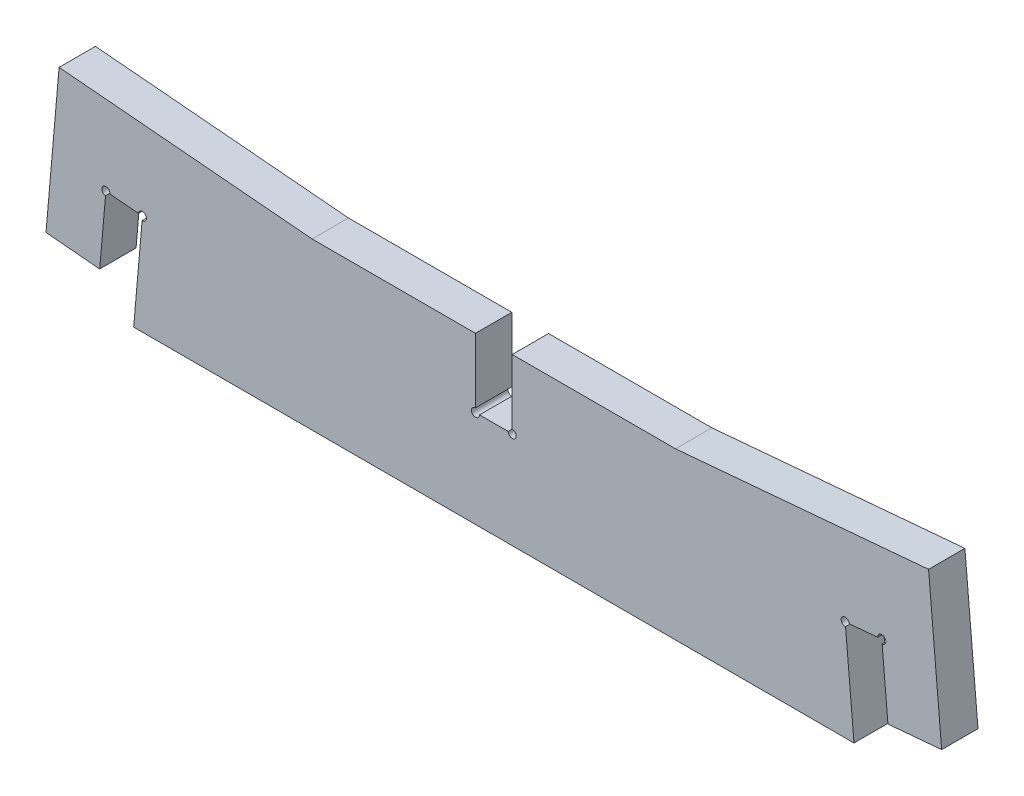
ISO-10303-21;
HEADER;
FILE_DESCRIPTION(('STEP AP214'),'2;1');
FILE_NAME('part.step','',(''),(''),'','','');
FILE_SCHEMA(('AUTOMOTIVE_DESIGN { 1 0 10303 214 1 1 1 1 }'));
ENDSEC;
DATA;
#1=APPLICATION_CONTEXT('core data for automotive mechanical design processes');
#2=APPLICATION_PROTOCOL_DEFINITION('international standard','automotive_design',2000,#1);
#3=PRODUCT_CONTEXT('',#1,'mechanical');
#4=PRODUCT('Part','Part','',(#3));
#5=PRODUCT_RELATED_PRODUCT_CATEGORY('part','',(#4));
#6=PRODUCT_DEFINITION_FORMATION('','',#4);
#7=PRODUCT_DEFINITION_CONTEXT('part definition',#1,'design');
#8=PRODUCT_DEFINITION('design','',#6,#7);
#9=PRODUCT_DEFINITION_SHAPE('','',#8);
#10=(LENGTH_UNIT() NAMED_UNIT(*) SI_UNIT(.MILLI.,.METRE.));
#11=(NAMED_UNIT(*) PLANE_ANGLE_UNIT() SI_UNIT($,.RADIAN.));
#12=(NAMED_UNIT(*) SI_UNIT($,.STERADIAN.) SOLID_ANGLE_UNIT());
#13=UNCERTAINTY_MEASURE_WITH_UNIT(LENGTH_MEASURE(1.E-05),#10,'distance_accuracy_value','');
#14=(GEOMETRIC_REPRESENTATION_CONTEXT(3) GLOBAL_UNCERTAINTY_ASSIGNED_CONTEXT((#13)) GLOBAL_UNIT_ASSIGNED_CONTEXT((#10,
#11,#12)) REPRESENTATION_CONTEXT('',''));
#15=CARTESIAN_POINT('',(0.,0.,0.));
#16=DIRECTION('',(0.,0.,1.));
#17=DIRECTION('',(1.,0.,0.));
#18=AXIS2_PLACEMENT_3D('',#15,#16,#17);
#19=CARTESIAN_POINT('',(90.,82.0000000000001,18.));
#20=DIRECTION('',(0.,-1.,0.));
#21=DIRECTION('',(1.,0.,0.));
#22=AXIS2_PLACEMENT_3D('',#19,#20,#21);
#23=PLANE('',#22);
#24=DIRECTION('',(0.,0.,-1.));
#25=VECTOR('',#24,1.);
#26=CARTESIAN_POINT('',(9.10000000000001,82.0000000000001,607.504185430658));
#27=LINE('',#26,#25);
#28=CARTESIAN_POINT('',(9.10000000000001,82.0000000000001,18.));
#29=VERTEX_POINT('',#28);
#30=CARTESIAN_POINT('',(9.10000000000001,82.0000000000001,0.));
#31=VERTEX_POINT('',#30);
#32=EDGE_CURVE('E374',#29,#31,#27,.T.);
#33=ORIENTED_EDGE('',*,*,#32,.F.);
#34=DIRECTION('',(-1.,0.,0.));
#35=VECTOR('',#34,1.);
#36=CARTESIAN_POINT('',(90.,82.0000000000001,18.));
#37=LINE('',#36,#35);
#38=CARTESIAN_POINT('',(90.,82.0000000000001,18.));
#39=VERTEX_POINT('',#38);
#40=EDGE_CURVE('E228',#39,#29,#37,.T.);
#41=ORIENTED_EDGE('',*,*,#40,.F.);
#42=DIRECTION('',(0.,0.,-1.));
#43=VECTOR('',#42,1.);
#44=CARTESIAN_POINT('',(90.,82.0000000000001,18.));
#45=LINE('',#44,#43);
#46=CARTESIAN_POINT('',(90.,82.0000000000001,0.));
#47=VERTEX_POINT('',#46);
#48=EDGE_CURVE('E298',#39,#47,#45,.T.);
#49=ORIENTED_EDGE('',*,*,#48,.T.);
#50=DIRECTION('',(-1.,0.,0.));
#51=VECTOR('',#50,1.);
#52=CARTESIAN_POINT('',(90.,82.0000000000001,0.));
#53=LINE('',#52,#51);
#54=EDGE_CURVE('E263',#47,#31,#53,.T.);
#55=ORIENTED_EDGE('',*,*,#54,.T.);
#56=EDGE_LOOP('',(#33,#41,#49,#55));
#57=FACE_BOUND('',#56,.T.);
#58=ADVANCED_FACE('F33',(#57),#23,.F.);
#59=DIRECTION('',(0.,0.,-1.));
#60=VECTOR('',#59,1.);
#61=CARTESIAN_POINT('',(-9.1,82.0000000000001,607.504185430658));
#62=LINE('',#61,#60);
#63=CARTESIAN_POINT('',(-9.1,82.0000000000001,18.));
#64=VERTEX_POINT('',#63);
#65=CARTESIAN_POINT('',(-9.1,82.0000000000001,0.));
#66=VERTEX_POINT('',#65);
#67=EDGE_CURVE('E371',#64,#66,#62,.T.);
#68=ORIENTED_EDGE('',*,*,#67,.T.);
#69=CARTESIAN_POINT('',(-90.,82.,0.));
#70=VERTEX_POINT('',#69);
#71=EDGE_CURVE('E262',#66,#70,#53,.T.);
#72=ORIENTED_EDGE('',*,*,#71,.T.);
#73=DIRECTION('',(0.,0.,-1.));
#74=VECTOR('',#73,1.);
#75=CARTESIAN_POINT('',(-90.,82.,18.));
#76=LINE('',#75,#74);
#77=CARTESIAN_POINT('',(-90.,82.,18.));
#78=VERTEX_POINT('',#77);
#79=EDGE_CURVE('E295',#78,#70,#76,.T.);
#80=ORIENTED_EDGE('',*,*,#79,.F.);
#81=EDGE_CURVE('E227',#64,#78,#37,.T.);
#82=ORIENTED_EDGE('',*,*,#81,.F.);
#83=EDGE_LOOP('',(#68,#72,#80,#82));
#84=FACE_BOUND('',#83,.T.);
#85=ADVANCED_FACE('F426',(#84),#23,.F.);
#86=CARTESIAN_POINT('',(0.,0.,18.));
#87=DIRECTION('',(0.,0.,-1.));
#88=DIRECTION('',(-1.,0.,0.));
#89=AXIS2_PLACEMENT_3D('',#86,#87,#88);
#90=PLANE('',#89);
#91=DIRECTION('',(-0.0871557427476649,0.996194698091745,0.));
#92=VECTOR('',#91,1.);
#93=CARTESIAN_POINT('',(178.383095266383,0.,18.));
#94=LINE('',#93,#92);
#95=CARTESIAN_POINT('',(178.383095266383,0.,18.));
#96=VERTEX_POINT('',#95);
#97=CARTESIAN_POINT('',(174.199619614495,47.8173455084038,18.));
#98=VERTEX_POINT('',#97);
#99=EDGE_CURVE('E208',#96,#98,#94,.T.);
#100=ORIENTED_EDGE('',*,*,#99,.T.);
#101=CARTESIAN_POINT('',(174.025308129,49.8097349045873,18.));
#102=DIRECTION('',(0.,0.,1.));
#103=DIRECTION('',(1.,0.,0.));
#104=AXIS2_PLACEMENT_3D('',#101,#102,#103);
#105=CIRCLE('',#104,2.);
#106=CARTESIAN_POINT('',(176.017697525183,49.9840463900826,18.));
#107=VERTEX_POINT('',#106);
#108=EDGE_CURVE('E193',#107,#98,#105,.T.);
#109=ORIENTED_EDGE('',*,*,#108,.F.);
#110=DIRECTION('',(0.996194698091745,0.0871557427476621,0.));
#111=VECTOR('',#110,1.);
#112=CARTESIAN_POINT('',(174.025308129,49.8097349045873,18.));
#113=LINE('',#112,#111);
#114=CARTESIAN_POINT('',(190.163662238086,51.2216579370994,18.));
#115=VERTEX_POINT('',#114);
#116=EDGE_CURVE('E205',#107,#115,#113,.T.);
#117=ORIENTED_EDGE('',*,*,#116,.T.);
#118=CARTESIAN_POINT('',(192.156051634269,51.3959694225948,18.));
#119=DIRECTION('',(0.,0.,1.));
#120=DIRECTION('',(1.,0.,0.));
#121=AXIS2_PLACEMENT_3D('',#118,#119,#120);
#122=CIRCLE('',#121,2.);
#123=CARTESIAN_POINT('',(192.330363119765,49.4035800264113,18.));
#124=VERTEX_POINT('',#123);
#125=EDGE_CURVE('E366',#124,#115,#122,.T.);
#126=ORIENTED_EDGE('',*,*,#125,.F.);
#127=DIRECTION('',(0.0871557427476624,-0.996194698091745,0.));
#128=VECTOR('',#127,1.);
#129=CARTESIAN_POINT('',(192.156051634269,51.3959694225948,18.));
#130=LINE('',#129,#128);
#131=CARTESIAN_POINT('',(195.206502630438,16.5291549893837,18.));
#132=VERTEX_POINT('',#131);
#133=EDGE_CURVE('E214',#124,#132,#130,.T.);
#134=ORIENTED_EDGE('',*,*,#133,.T.);
#135=DIRECTION('',(0.996194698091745,0.0871557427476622,0.));
#136=VECTOR('',#135,1.);
#137=CARTESIAN_POINT('',(195.206502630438,16.5291549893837,18.));
#138=LINE('',#137,#136);
#139=CARTESIAN_POINT('',(221.804901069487,18.8562133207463,18.));
#140=VERTEX_POINT('',#139);
#141=EDGE_CURVE('E216',#132,#140,#138,.T.);
#142=ORIENTED_EDGE('',*,*,#141,.T.);
#143=DIRECTION('',(-0.0871557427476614,0.996194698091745,0.));
#144=VECTOR('',#143,1.);
#145=CARTESIAN_POINT('',(221.804901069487,18.8562133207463,18.));
#146=LINE('',#145,#144);
#147=CARTESIAN_POINT('',(215.321293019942,92.964192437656,18.));
#148=VERTEX_POINT('',#147);
#149=EDGE_CURVE('E223',#140,#148,#146,.T.);
#150=ORIENTED_EDGE('',*,*,#149,.T.);
#151=DIRECTION('',(-0.996194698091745,-0.0871557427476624,0.));
#152=VECTOR('',#151,1.);
#153=CARTESIAN_POINT('',(215.321293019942,92.964192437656,18.));
#154=LINE('',#153,#152);
#155=EDGE_CURVE('E225',#148,#39,#154,.T.);
#156=ORIENTED_EDGE('',*,*,#155,.T.);
#157=ORIENTED_EDGE('',*,*,#40,.T.);
#158=DIRECTION('',(0.,1.,0.));
#159=VECTOR('',#158,1.);
#160=CARTESIAN_POINT('',(9.10000000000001,0.,18.));
#161=LINE('',#160,#159);
#162=CARTESIAN_POINT('',(9.10000000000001,50.0000000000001,18.));
#163=VERTEX_POINT('',#162);
#164=EDGE_CURVE('E252',#163,#29,#161,.T.);
#165=ORIENTED_EDGE('',*,*,#164,.F.);
#166=CARTESIAN_POINT('',(9.10000000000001,48.0000000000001,18.));
#167=DIRECTION('',(0.,0.,1.));
#168=DIRECTION('',(1.,0.,0.));
#169=AXIS2_PLACEMENT_3D('',#166,#167,#168);
#170=CIRCLE('',#169,2.);
#171=CARTESIAN_POINT('',(7.10000000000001,48.0000000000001,18.));
#172=VERTEX_POINT('',#171);
#173=EDGE_CURVE('E334',#172,#163,#170,.T.);
#174=ORIENTED_EDGE('',*,*,#173,.F.);
#175=DIRECTION('',(1.,0.,0.));
#176=VECTOR('',#175,1.);
#177=CARTESIAN_POINT('',(0.,48.0000000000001,18.));
#178=LINE('',#177,#176);
#179=CARTESIAN_POINT('',(-7.09999999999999,48.0000000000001,18.));
#180=VERTEX_POINT('',#179);
#181=EDGE_CURVE('E328',#180,#172,#178,.T.);
#182=ORIENTED_EDGE('',*,*,#181,.F.);
#183=CARTESIAN_POINT('',(-9.09999999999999,48.0000000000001,18.));
#184=DIRECTION('',(0.,0.,1.));
#185=DIRECTION('',(1.,0.,0.));
#186=AXIS2_PLACEMENT_3D('',#183,#184,#185);
#187=CIRCLE('',#186,2.);
#188=CARTESIAN_POINT('',(-9.09999999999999,50.0000000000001,18.));
#189=VERTEX_POINT('',#188);
#190=EDGE_CURVE('E336',#189,#180,#187,.T.);
#191=ORIENTED_EDGE('',*,*,#190,.F.);
#192=DIRECTION('',(0.,-1.,0.));
#193=VECTOR('',#192,1.);
#194=CARTESIAN_POINT('',(-9.09999999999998,0.,18.));
#195=LINE('',#194,#193);
#196=EDGE_CURVE('E377',#64,#189,#195,.T.);
#197=ORIENTED_EDGE('',*,*,#196,.F.);
#198=ORIENTED_EDGE('',*,*,#81,.T.);
#199=DIRECTION('',(-0.996194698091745,0.0871557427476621,0.));
#200=VECTOR('',#199,1.);
#201=CARTESIAN_POINT('',(-215.321293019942,92.9641924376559,18.));
#202=LINE('',#201,#200);
#203=CARTESIAN_POINT('',(-215.321293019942,92.9641924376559,18.));
#204=VERTEX_POINT('',#203);
#205=EDGE_CURVE('E231',#78,#204,#202,.T.);
#206=ORIENTED_EDGE('',*,*,#205,.T.);
#207=DIRECTION('',(-0.0871557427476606,-0.996194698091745,0.));
#208=VECTOR('',#207,1.);
#209=CARTESIAN_POINT('',(-221.804901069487,18.8562133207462,18.));
#210=LINE('',#209,#208);
#211=CARTESIAN_POINT('',(-221.804901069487,18.8562133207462,18.));
#212=VERTEX_POINT('',#211);
#213=EDGE_CURVE('E233',#204,#212,#210,.T.);
#214=ORIENTED_EDGE('',*,*,#213,.T.);
#215=DIRECTION('',(0.996194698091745,-0.0871557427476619,0.));
#216=VECTOR('',#215,1.);
#217=CARTESIAN_POINT('',(-195.206502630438,16.5291549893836,18.));
#218=LINE('',#217,#216);
#219=CARTESIAN_POINT('',(-195.206502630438,16.5291549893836,18.));
#220=VERTEX_POINT('',#219);
#221=EDGE_CURVE('E235',#212,#220,#218,.T.);
#222=ORIENTED_EDGE('',*,*,#221,.T.);
#223=DIRECTION('',(0.0871557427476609,0.996194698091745,0.));
#224=VECTOR('',#223,1.);
#225=CARTESIAN_POINT('',(-192.156051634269,51.3959694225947,18.));
#226=LINE('',#225,#224);
#227=CARTESIAN_POINT('',(-192.330363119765,49.4035800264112,18.));
#228=VERTEX_POINT('',#227);
#229=EDGE_CURVE('E237',#220,#228,#226,.T.);
#230=ORIENTED_EDGE('',*,*,#229,.T.);
#231=CARTESIAN_POINT('',(-192.156051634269,51.3959694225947,18.));
#232=DIRECTION('',(0.,0.,1.));
#233=DIRECTION('',(1.,0.,0.));
#234=AXIS2_PLACEMENT_3D('',#231,#232,#233);
#235=CIRCLE('',#234,2.);
#236=CARTESIAN_POINT('',(-190.163662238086,51.2216579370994,18.));
#237=VERTEX_POINT('',#236);
#238=EDGE_CURVE('E360',#237,#228,#235,.T.);
#239=ORIENTED_EDGE('',*,*,#238,.F.);
#240=DIRECTION('',(0.996194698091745,-0.0871557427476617,0.));
#241=VECTOR('',#240,1.);
#242=CARTESIAN_POINT('',(-174.025308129,49.8097349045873,18.));
#243=LINE('',#242,#241);
#244=CARTESIAN_POINT('',(-176.017697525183,49.9840463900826,18.));
#245=VERTEX_POINT('',#244);
#246=EDGE_CURVE('E240',#237,#245,#243,.T.);
#247=ORIENTED_EDGE('',*,*,#246,.T.);
#248=CARTESIAN_POINT('',(-174.025308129,49.8097349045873,18.));
#249=DIRECTION('',(0.,0.,1.));
#250=DIRECTION('',(1.,0.,0.));
#251=AXIS2_PLACEMENT_3D('',#248,#249,#250);
#252=CIRCLE('',#251,2.);
#253=CARTESIAN_POINT('',(-174.199619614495,47.8173455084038,18.));
#254=VERTEX_POINT('',#253);
#255=EDGE_CURVE('E352',#254,#245,#252,.T.);
#256=ORIENTED_EDGE('',*,*,#255,.F.);
#257=DIRECTION('',(-0.0871557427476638,-0.996194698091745,0.));
#258=VECTOR('',#257,1.);
#259=CARTESIAN_POINT('',(-178.383095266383,0.,18.));
#260=LINE('',#259,#258);
#261=CARTESIAN_POINT('',(-178.383095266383,0.,18.));
#262=VERTEX_POINT('',#261);
#263=EDGE_CURVE('E243',#254,#262,#260,.T.);
#264=ORIENTED_EDGE('',*,*,#263,.T.);
#265=DIRECTION('',(1.,0.,0.));
#266=VECTOR('',#265,1.);
#267=CARTESIAN_POINT('',(-178.383095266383,0.,18.));
#268=LINE('',#267,#266);
#269=EDGE_CURVE('E245',#262,#96,#268,.T.);
#270=ORIENTED_EDGE('',*,*,#269,.T.);
#271=EDGE_LOOP('',(#100,#109,#117,#126,#134,#142,#150,#156,#157,#165,#174,#182,#191,#197,#198,
#206,#214,#222,#230,#239,#247,#256,#264,#270));
#272=FACE_BOUND('',#271,.T.);
#273=ADVANCED_FACE('F203',(#272),#90,.F.);
#274=CARTESIAN_POINT('',(0.,0.,0.));
#275=DIRECTION('',(0.,0.,-1.));
#276=DIRECTION('',(-1.,0.,0.));
#277=AXIS2_PLACEMENT_3D('',#274,#275,#276);
#278=PLANE('',#277);
#279=CARTESIAN_POINT('',(174.025308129,49.8097349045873,0.));
#280=DIRECTION('',(0.,0.,-1.));
#281=DIRECTION('',(-1.,0.,0.));
#282=AXIS2_PLACEMENT_3D('',#279,#280,#281);
#283=CIRCLE('',#282,2.);
#284=CARTESIAN_POINT('',(176.017697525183,49.9840463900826,0.));
#285=VERTEX_POINT('',#284);
#286=CARTESIAN_POINT('',(174.199619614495,47.8173455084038,0.));
#287=VERTEX_POINT('',#286);
#288=EDGE_CURVE('E48',#285,#287,#283,.F.);
#289=ORIENTED_EDGE('',*,*,#288,.T.);
#290=DIRECTION('',(-0.0871557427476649,0.996194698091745,0.));
#291=VECTOR('',#290,1.);
#292=CARTESIAN_POINT('',(178.383095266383,0.,0.));
#293=LINE('',#292,#291);
#294=CARTESIAN_POINT('',(178.383095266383,0.,0.));
#295=VERTEX_POINT('',#294);
#296=EDGE_CURVE('E248',#295,#287,#293,.T.);
#297=ORIENTED_EDGE('',*,*,#296,.F.);
#298=DIRECTION('',(1.,0.,0.));
#299=VECTOR('',#298,1.);
#300=CARTESIAN_POINT('',(-178.383095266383,0.,0.));
#301=LINE('',#300,#299);
#302=CARTESIAN_POINT('',(-178.383095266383,0.,0.));
#303=VERTEX_POINT('',#302);
#304=EDGE_CURVE('E218',#303,#295,#301,.T.);
#305=ORIENTED_EDGE('',*,*,#304,.F.);
#306=DIRECTION('',(-0.0871557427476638,-0.996194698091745,0.));
#307=VECTOR('',#306,1.);
#308=CARTESIAN_POINT('',(-178.383095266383,0.,0.));
#309=LINE('',#308,#307);
#310=CARTESIAN_POINT('',(-174.199619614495,47.8173455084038,0.));
#311=VERTEX_POINT('',#310);
#312=EDGE_CURVE('E278',#311,#303,#309,.T.);
#313=ORIENTED_EDGE('',*,*,#312,.F.);
#314=CARTESIAN_POINT('',(-174.025308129,49.8097349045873,0.));
#315=DIRECTION('',(0.,0.,-1.));
#316=DIRECTION('',(-1.,0.,0.));
#317=AXIS2_PLACEMENT_3D('',#314,#315,#316);
#318=CIRCLE('',#317,2.);
#319=CARTESIAN_POINT('',(-176.017697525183,49.9840463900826,0.));
#320=VERTEX_POINT('',#319);
#321=EDGE_CURVE('E345',#311,#320,#318,.F.);
#322=ORIENTED_EDGE('',*,*,#321,.T.);
#323=DIRECTION('',(0.996194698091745,-0.0871557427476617,0.));
#324=VECTOR('',#323,1.);
#325=CARTESIAN_POINT('',(-174.025308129,49.8097349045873,0.));
#326=LINE('',#325,#324);
#327=CARTESIAN_POINT('',(-190.163662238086,51.2216579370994,0.));
#328=VERTEX_POINT('',#327);
#329=EDGE_CURVE('E275',#328,#320,#326,.T.);
#330=ORIENTED_EDGE('',*,*,#329,.F.);
#331=CARTESIAN_POINT('',(-192.156051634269,51.3959694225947,0.));
#332=DIRECTION('',(0.,0.,-1.));
#333=DIRECTION('',(-1.,0.,0.));
#334=AXIS2_PLACEMENT_3D('',#331,#332,#333);
#335=CIRCLE('',#334,2.);
#336=CARTESIAN_POINT('',(-192.330363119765,49.4035800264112,0.));
#337=VERTEX_POINT('',#336);
#338=EDGE_CURVE('E56',#328,#337,#335,.F.);
#339=ORIENTED_EDGE('',*,*,#338,.T.);
#340=DIRECTION('',(0.0871557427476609,0.996194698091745,0.));
#341=VECTOR('',#340,1.);
#342=CARTESIAN_POINT('',(-192.156051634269,51.3959694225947,0.));
#343=LINE('',#342,#341);
#344=CARTESIAN_POINT('',(-195.206502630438,16.5291549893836,0.));
#345=VERTEX_POINT('',#344);
#346=EDGE_CURVE('E272',#345,#337,#343,.T.);
#347=ORIENTED_EDGE('',*,*,#346,.F.);
#348=DIRECTION('',(0.996194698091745,-0.0871557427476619,0.));
#349=VECTOR('',#348,1.);
#350=CARTESIAN_POINT('',(-195.206502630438,16.5291549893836,0.));
#351=LINE('',#350,#349);
#352=CARTESIAN_POINT('',(-221.804901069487,18.8562133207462,0.));
#353=VERTEX_POINT('',#352);
#354=EDGE_CURVE('E270',#353,#345,#351,.T.);
#355=ORIENTED_EDGE('',*,*,#354,.F.);
#356=DIRECTION('',(-0.0871557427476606,-0.996194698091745,0.));
#357=VECTOR('',#356,1.);
#358=CARTESIAN_POINT('',(-221.804901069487,18.8562133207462,0.));
#359=LINE('',#358,#357);
#360=CARTESIAN_POINT('',(-215.321293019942,92.9641924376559,0.));
#361=VERTEX_POINT('',#360);
#362=EDGE_CURVE('E268',#361,#353,#359,.T.);
#363=ORIENTED_EDGE('',*,*,#362,.F.);
#364=DIRECTION('',(-0.996194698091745,0.0871557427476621,0.));
#365=VECTOR('',#364,1.);
#366=CARTESIAN_POINT('',(-215.321293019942,92.9641924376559,0.));
#367=LINE('',#366,#365);
#368=EDGE_CURVE('E266',#70,#361,#367,.T.);
#369=ORIENTED_EDGE('',*,*,#368,.F.);
#370=ORIENTED_EDGE('',*,*,#71,.F.);
#371=DIRECTION('',(0.,-1.,0.));
#372=VECTOR('',#371,1.);
#373=CARTESIAN_POINT('',(-9.09999999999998,0.,0.));
#374=LINE('',#373,#372);
#375=CARTESIAN_POINT('',(-9.09999999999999,50.0000000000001,0.));
#376=VERTEX_POINT('',#375);
#377=EDGE_CURVE('E310',#66,#376,#374,.T.);
#378=ORIENTED_EDGE('',*,*,#377,.T.);
#379=CARTESIAN_POINT('',(-9.09999999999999,48.0000000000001,0.));
#380=DIRECTION('',(0.,0.,-1.));
#381=DIRECTION('',(-1.,0.,0.));
#382=AXIS2_PLACEMENT_3D('',#379,#380,#381);
#383=CIRCLE('',#382,2.);
#384=CARTESIAN_POINT('',(-7.09999999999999,48.0000000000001,0.));
#385=VERTEX_POINT('',#384);
#386=EDGE_CURVE('E319',#376,#385,#383,.F.);
#387=ORIENTED_EDGE('',*,*,#386,.T.);
#388=DIRECTION('',(1.,0.,0.));
#389=VECTOR('',#388,1.);
#390=CARTESIAN_POINT('',(0.,48.0000000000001,0.));
#391=LINE('',#390,#389);
#392=CARTESIAN_POINT('',(7.10000000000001,48.0000000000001,0.));
#393=VERTEX_POINT('',#392);
#394=EDGE_CURVE('E41',#385,#393,#391,.T.);
#395=ORIENTED_EDGE('',*,*,#394,.T.);
#396=CARTESIAN_POINT('',(9.10000000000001,48.0000000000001,0.));
#397=DIRECTION('',(0.,0.,-1.));
#398=DIRECTION('',(-1.,0.,0.));
#399=AXIS2_PLACEMENT_3D('',#396,#397,#398);
#400=CIRCLE('',#399,2.);
#401=CARTESIAN_POINT('',(9.10000000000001,50.0000000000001,0.));
#402=VERTEX_POINT('',#401);
#403=EDGE_CURVE('E199',#393,#402,#400,.F.);
#404=ORIENTED_EDGE('',*,*,#403,.T.);
#405=DIRECTION('',(0.,1.,0.));
#406=VECTOR('',#405,1.);
#407=CARTESIAN_POINT('',(9.10000000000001,0.,0.));
#408=LINE('',#407,#406);
#409=EDGE_CURVE('E11',#402,#31,#408,.T.);
#410=ORIENTED_EDGE('',*,*,#409,.T.);
#411=ORIENTED_EDGE('',*,*,#54,.F.);
#412=DIRECTION('',(-0.996194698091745,-0.0871557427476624,0.));
#413=VECTOR('',#412,1.);
#414=CARTESIAN_POINT('',(215.321293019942,92.964192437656,0.));
#415=LINE('',#414,#413);
#416=CARTESIAN_POINT('',(215.321293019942,92.964192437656,0.));
#417=VERTEX_POINT('',#416);
#418=EDGE_CURVE('E260',#417,#47,#415,.T.);
#419=ORIENTED_EDGE('',*,*,#418,.F.);
#420=DIRECTION('',(-0.0871557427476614,0.996194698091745,0.));
#421=VECTOR('',#420,1.);
#422=CARTESIAN_POINT('',(221.804901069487,18.8562133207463,0.));
#423=LINE('',#422,#421);
#424=CARTESIAN_POINT('',(221.804901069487,18.8562133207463,0.));
#425=VERTEX_POINT('',#424);
#426=EDGE_CURVE('E258',#425,#417,#423,.T.);
#427=ORIENTED_EDGE('',*,*,#426,.F.);
#428=DIRECTION('',(0.996194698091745,0.0871557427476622,0.));
#429=VECTOR('',#428,1.);
#430=CARTESIAN_POINT('',(195.206502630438,16.5291549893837,0.));
#431=LINE('',#430,#429);
#432=CARTESIAN_POINT('',(195.206502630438,16.5291549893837,0.));
#433=VERTEX_POINT('',#432);
#434=EDGE_CURVE('E256',#433,#425,#431,.T.);
#435=ORIENTED_EDGE('',*,*,#434,.F.);
#436=DIRECTION('',(0.0871557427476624,-0.996194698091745,0.));
#437=VECTOR('',#436,1.);
#438=CARTESIAN_POINT('',(192.156051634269,51.3959694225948,0.));
#439=LINE('',#438,#437);
#440=CARTESIAN_POINT('',(192.330363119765,49.4035800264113,0.));
#441=VERTEX_POINT('',#440);
#442=EDGE_CURVE('E254',#441,#433,#439,.T.);
#443=ORIENTED_EDGE('',*,*,#442,.F.);
#444=CARTESIAN_POINT('',(192.156051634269,51.3959694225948,0.));
#445=DIRECTION('',(0.,0.,-1.));
#446=DIRECTION('',(-1.,0.,0.));
#447=AXIS2_PLACEMENT_3D('',#444,#445,#446);
#448=CIRCLE('',#447,2.);
#449=CARTESIAN_POINT('',(190.163662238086,51.2216579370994,0.));
#450=VERTEX_POINT('',#449);
#451=EDGE_CURVE('E368',#441,#450,#448,.F.);
#452=ORIENTED_EDGE('',*,*,#451,.T.);
#453=DIRECTION('',(0.996194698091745,0.0871557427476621,0.));
#454=VECTOR('',#453,1.);
#455=CARTESIAN_POINT('',(174.025308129,49.8097349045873,0.));
#456=LINE('',#455,#454);
#457=EDGE_CURVE('E251',#285,#450,#456,.T.);
#458=ORIENTED_EDGE('',*,*,#457,.F.);
#459=EDGE_LOOP('',(#289,#297,#305,#313,#322,#330,#339,#347,#355,#363,#369,#370,#378,#387,#395,
#404,#410,#411,#419,#427,#435,#443,#452,#458));
#460=FACE_BOUND('',#459,.T.);
#461=ADVANCED_FACE('F317',(#460),#278,.T.);
#462=CARTESIAN_POINT('',(178.383095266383,0.,18.));
#463=DIRECTION('',(-0.996194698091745,-0.0871557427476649,0.));
#464=DIRECTION('',(0.0871557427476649,-0.996194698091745,0.));
#465=AXIS2_PLACEMENT_3D('',#462,#463,#464);
#466=PLANE('',#465);
#467=ORIENTED_EDGE('',*,*,#296,.T.);
#468=DIRECTION('',(0.,0.,1.));
#469=VECTOR('',#468,1.);
#470=CARTESIAN_POINT('',(174.199619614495,47.8173455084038,-0.001000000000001));
#471=LINE('',#470,#469);
#472=EDGE_CURVE('E198',#98,#287,#471,.F.);
#473=ORIENTED_EDGE('',*,*,#472,.F.);
#474=ORIENTED_EDGE('',*,*,#99,.F.);
#475=DIRECTION('',(0.,0.,-1.));
#476=VECTOR('',#475,1.);
#477=CARTESIAN_POINT('',(178.383095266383,0.,18.));
#478=LINE('',#477,#476);
#479=EDGE_CURVE('E247',#96,#295,#478,.T.);
#480=ORIENTED_EDGE('',*,*,#479,.T.);
#481=EDGE_LOOP('',(#467,#473,#474,#480));
#482=FACE_BOUND('',#481,.T.);
#483=ADVANCED_FACE('F35',(#482),#466,.F.);
#484=CARTESIAN_POINT('',(174.025308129,49.8097349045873,18.));
#485=DIRECTION('',(-0.0871557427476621,0.996194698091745,0.));
#486=DIRECTION('',(-0.996194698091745,-0.0871557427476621,0.));
#487=AXIS2_PLACEMENT_3D('',#484,#485,#486);
#488=PLANE('',#487);
#489=ORIENTED_EDGE('',*,*,#116,.F.);
#490=DIRECTION('',(0.,0.,1.));
#491=VECTOR('',#490,1.);
#492=CARTESIAN_POINT('',(176.017697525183,49.9840463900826,-0.001000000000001));
#493=LINE('',#492,#491);
#494=EDGE_CURVE('E190',#285,#107,#493,.T.);
#495=ORIENTED_EDGE('',*,*,#494,.F.);
#496=ORIENTED_EDGE('',*,*,#457,.T.);
#497=DIRECTION('',(0.,0.,1.));
#498=VECTOR('',#497,1.);
#499=CARTESIAN_POINT('',(190.163662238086,51.2216579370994,-0.001000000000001));
#500=LINE('',#499,#498);
#501=EDGE_CURVE('E213',#115,#450,#500,.F.);
#502=ORIENTED_EDGE('',*,*,#501,.F.);
#503=EDGE_LOOP('',(#489,#495,#496,#502));
#504=FACE_BOUND('',#503,.T.);
#505=ADVANCED_FACE('F211',(#504),#488,.F.);
#506=CARTESIAN_POINT('',(192.156051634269,51.3959694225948,18.));
#507=DIRECTION('',(0.996194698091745,0.0871557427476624,0.));
#508=DIRECTION('',(-0.0871557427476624,0.996194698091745,0.));
#509=AXIS2_PLACEMENT_3D('',#506,#507,#508);
#510=PLANE('',#509);
#511=ORIENTED_EDGE('',*,*,#133,.F.);
#512=DIRECTION('',(0.,0.,1.));
#513=VECTOR('',#512,1.);
#514=CARTESIAN_POINT('',(192.330363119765,49.4035800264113,-0.001000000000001));
#515=LINE('',#514,#513);
#516=EDGE_CURVE('E363',#441,#124,#515,.T.);
#517=ORIENTED_EDGE('',*,*,#516,.F.);
#518=ORIENTED_EDGE('',*,*,#442,.T.);
#519=DIRECTION('',(0.,0.,-1.));
#520=VECTOR('',#519,1.);
#521=CARTESIAN_POINT('',(195.206502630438,16.5291549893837,18.));
#522=LINE('',#521,#520);
#523=EDGE_CURVE('E307',#132,#433,#522,.T.);
#524=ORIENTED_EDGE('',*,*,#523,.F.);
#525=EDGE_LOOP('',(#511,#517,#518,#524));
#526=FACE_BOUND('',#525,.T.);
#527=ADVANCED_FACE('F406',(#526),#510,.F.);
#528=CARTESIAN_POINT('',(195.206502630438,16.5291549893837,18.));
#529=DIRECTION('',(-0.0871557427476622,0.996194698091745,0.));
#530=DIRECTION('',(-0.996194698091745,-0.0871557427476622,0.));
#531=AXIS2_PLACEMENT_3D('',#528,#529,#530);
#532=PLANE('',#531);
#533=ORIENTED_EDGE('',*,*,#434,.T.);
#534=DIRECTION('',(0.,0.,-1.));
#535=VECTOR('',#534,1.);
#536=CARTESIAN_POINT('',(221.804901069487,18.8562133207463,18.));
#537=LINE('',#536,#535);
#538=EDGE_CURVE('E304',#140,#425,#537,.T.);
#539=ORIENTED_EDGE('',*,*,#538,.F.);
#540=ORIENTED_EDGE('',*,*,#141,.F.);
#541=ORIENTED_EDGE('',*,*,#523,.T.);
#542=EDGE_LOOP('',(#533,#539,#540,#541));
#543=FACE_BOUND('',#542,.T.);
#544=ADVANCED_FACE('F402',(#543),#532,.F.);
#545=CARTESIAN_POINT('',(221.804901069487,18.8562133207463,18.));
#546=DIRECTION('',(-0.996194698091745,-0.0871557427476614,0.));
#547=DIRECTION('',(0.0871557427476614,-0.996194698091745,0.));
#548=AXIS2_PLACEMENT_3D('',#545,#546,#547);
#549=PLANE('',#548);
#550=ORIENTED_EDGE('',*,*,#426,.T.);
#551=DIRECTION('',(0.,0.,-1.));
#552=VECTOR('',#551,1.);
#553=CARTESIAN_POINT('',(215.321293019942,92.964192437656,18.));
#554=LINE('',#553,#552);
#555=EDGE_CURVE('E301',#148,#417,#554,.T.);
#556=ORIENTED_EDGE('',*,*,#555,.F.);
#557=ORIENTED_EDGE('',*,*,#149,.F.);
#558=ORIENTED_EDGE('',*,*,#538,.T.);
#559=EDGE_LOOP('',(#550,#556,#557,#558));
#560=FACE_BOUND('',#559,.T.);
#561=ADVANCED_FACE('F398',(#560),#549,.F.);
#562=CARTESIAN_POINT('',(215.321293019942,92.964192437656,18.));
#563=DIRECTION('',(0.0871557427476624,-0.996194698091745,0.));
#564=DIRECTION('',(0.996194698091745,0.0871557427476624,0.));
#565=AXIS2_PLACEMENT_3D('',#562,#563,#564);
#566=PLANE('',#565);
#567=ORIENTED_EDGE('',*,*,#418,.T.);
#568=ORIENTED_EDGE('',*,*,#48,.F.);
#569=ORIENTED_EDGE('',*,*,#155,.F.);
#570=ORIENTED_EDGE('',*,*,#555,.T.);
#571=EDGE_LOOP('',(#567,#568,#569,#570));
#572=FACE_BOUND('',#571,.T.);
#573=ADVANCED_FACE('F392',(#572),#566,.F.);
#574=CARTESIAN_POINT('',(-215.321293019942,92.9641924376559,18.));
#575=DIRECTION('',(-0.0871557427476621,-0.996194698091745,0.));
#576=DIRECTION('',(0.996194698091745,-0.0871557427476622,0.));
#577=AXIS2_PLACEMENT_3D('',#574,#575,#576);
#578=PLANE('',#577);
#579=ORIENTED_EDGE('',*,*,#368,.T.);
#580=DIRECTION('',(0.,0.,-1.));
#581=VECTOR('',#580,1.);
#582=CARTESIAN_POINT('',(-215.321293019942,92.9641924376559,18.));
#583=LINE('',#582,#581);
#584=EDGE_CURVE('E292',#204,#361,#583,.T.);
#585=ORIENTED_EDGE('',*,*,#584,.F.);
#586=ORIENTED_EDGE('',*,*,#205,.F.);
#587=ORIENTED_EDGE('',*,*,#79,.T.);
#588=EDGE_LOOP('',(#579,#585,#586,#587));
#589=FACE_BOUND('',#588,.T.);
#590=ADVANCED_FACE('F434',(#589),#578,.F.);
#591=CARTESIAN_POINT('',(-221.804901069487,18.8562133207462,18.));
#592=DIRECTION('',(0.996194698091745,-0.0871557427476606,0.));
#593=DIRECTION('',(0.0871557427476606,0.996194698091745,0.));
#594=AXIS2_PLACEMENT_3D('',#591,#592,#593);
#595=PLANE('',#594);
#596=ORIENTED_EDGE('',*,*,#362,.T.);
#597=DIRECTION('',(0.,0.,-1.));
#598=VECTOR('',#597,1.);
#599=CARTESIAN_POINT('',(-221.804901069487,18.8562133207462,18.));
#600=LINE('',#599,#598);
#601=EDGE_CURVE('E289',#212,#353,#600,.T.);
#602=ORIENTED_EDGE('',*,*,#601,.F.);
#603=ORIENTED_EDGE('',*,*,#213,.F.);
#604=ORIENTED_EDGE('',*,*,#584,.T.);
#605=EDGE_LOOP('',(#596,#602,#603,#604));
#606=FACE_BOUND('',#605,.T.);
#607=ADVANCED_FACE('F488',(#606),#595,.F.);
#608=CARTESIAN_POINT('',(-195.206502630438,16.5291549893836,18.));
#609=DIRECTION('',(0.0871557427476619,0.996194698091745,0.));
#610=DIRECTION('',(-0.996194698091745,0.087155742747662,0.));
#611=AXIS2_PLACEMENT_3D('',#608,#609,#610);
#612=PLANE('',#611);
#613=ORIENTED_EDGE('',*,*,#354,.T.);
#614=DIRECTION('',(0.,0.,-1.));
#615=VECTOR('',#614,1.);
#616=CARTESIAN_POINT('',(-195.206502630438,16.5291549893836,18.));
#617=LINE('',#616,#615);
#618=EDGE_CURVE('E286',#220,#345,#617,.T.);
#619=ORIENTED_EDGE('',*,*,#618,.F.);
#620=ORIENTED_EDGE('',*,*,#221,.F.);
#621=ORIENTED_EDGE('',*,*,#601,.T.);
#622=EDGE_LOOP('',(#613,#619,#620,#621));
#623=FACE_BOUND('',#622,.T.);
#624=ADVANCED_FACE('F482',(#623),#612,.F.);
#625=CARTESIAN_POINT('',(-192.156051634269,51.3959694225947,18.));
#626=DIRECTION('',(-0.996194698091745,0.0871557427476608,0.));
#627=DIRECTION('',(-0.0871557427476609,-0.996194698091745,0.));
#628=AXIS2_PLACEMENT_3D('',#625,#626,#627);
#629=PLANE('',#628);
#630=ORIENTED_EDGE('',*,*,#346,.T.);
#631=DIRECTION('',(0.,0.,1.));
#632=VECTOR('',#631,1.);
#633=CARTESIAN_POINT('',(-192.330363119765,49.4035800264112,-0.001000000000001));
#634=LINE('',#633,#632);
#635=EDGE_CURVE('E358',#228,#337,#634,.F.);
#636=ORIENTED_EDGE('',*,*,#635,.F.);
#637=ORIENTED_EDGE('',*,*,#229,.F.);
#638=ORIENTED_EDGE('',*,*,#618,.T.);
#639=EDGE_LOOP('',(#630,#636,#637,#638));
#640=FACE_BOUND('',#639,.T.);
#641=ADVANCED_FACE('F477',(#640),#629,.F.);
#642=CARTESIAN_POINT('',(-174.025308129,49.8097349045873,18.));
#643=DIRECTION('',(0.0871557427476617,0.996194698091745,0.));
#644=DIRECTION('',(-0.996194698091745,0.0871557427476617,0.));
#645=AXIS2_PLACEMENT_3D('',#642,#643,#644);
#646=PLANE('',#645);
#647=ORIENTED_EDGE('',*,*,#329,.T.);
#648=DIRECTION('',(0.,0.,1.));
#649=VECTOR('',#648,1.);
#650=CARTESIAN_POINT('',(-176.017697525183,49.9840463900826,-0.001000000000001));
#651=LINE('',#650,#649);
#652=EDGE_CURVE('E350',#245,#320,#651,.F.);
#653=ORIENTED_EDGE('',*,*,#652,.F.);
#654=ORIENTED_EDGE('',*,*,#246,.F.);
#655=DIRECTION('',(0.,0.,1.));
#656=VECTOR('',#655,1.);
#657=CARTESIAN_POINT('',(-190.163662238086,51.2216579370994,-0.001000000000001));
#658=LINE('',#657,#656);
#659=EDGE_CURVE('E356',#328,#237,#658,.T.);
#660=ORIENTED_EDGE('',*,*,#659,.F.);
#661=EDGE_LOOP('',(#647,#653,#654,#660));
#662=FACE_BOUND('',#661,.T.);
#663=ADVANCED_FACE('F471',(#662),#646,.F.);
#664=CARTESIAN_POINT('',(-178.383095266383,0.,18.));
#665=DIRECTION('',(0.996194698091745,-0.0871557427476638,0.));
#666=DIRECTION('',(0.0871557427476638,0.996194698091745,0.));
#667=AXIS2_PLACEMENT_3D('',#664,#665,#666);
#668=PLANE('',#667);
#669=ORIENTED_EDGE('',*,*,#263,.F.);
#670=DIRECTION('',(0.,0.,1.));
#671=VECTOR('',#670,1.);
#672=CARTESIAN_POINT('',(-174.199619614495,47.8173455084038,-0.001000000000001));
#673=LINE('',#672,#671);
#674=EDGE_CURVE('E348',#311,#254,#673,.T.);
#675=ORIENTED_EDGE('',*,*,#674,.F.);
#676=ORIENTED_EDGE('',*,*,#312,.T.);
#677=DIRECTION('',(0.,0.,-1.));
#678=VECTOR('',#677,1.);
#679=CARTESIAN_POINT('',(-178.383095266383,0.,18.));
#680=LINE('',#679,#678);
#681=EDGE_CURVE('E283',#262,#303,#680,.T.);
#682=ORIENTED_EDGE('',*,*,#681,.F.);
#683=EDGE_LOOP('',(#669,#675,#676,#682));
#684=FACE_BOUND('',#683,.T.);
#685=ADVANCED_FACE('F462',(#684),#668,.F.);
#686=CARTESIAN_POINT('',(-178.383095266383,0.,18.));
#687=DIRECTION('',(0.,1.,0.));
#688=DIRECTION('',(-1.,0.,0.));
#689=AXIS2_PLACEMENT_3D('',#686,#687,#688);
#690=PLANE('',#689);
#691=ORIENTED_EDGE('',*,*,#304,.T.);
#692=ORIENTED_EDGE('',*,*,#479,.F.);
#693=ORIENTED_EDGE('',*,*,#269,.F.);
#694=ORIENTED_EDGE('',*,*,#681,.T.);
#695=EDGE_LOOP('',(#691,#692,#693,#694));
#696=FACE_BOUND('',#695,.T.);
#697=ADVANCED_FACE('F457',(#696),#690,.F.);
#698=CARTESIAN_POINT('',(9.10000000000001,82.0000000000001,607.504185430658));
#699=DIRECTION('',(-1.,0.,0.));
#700=DIRECTION('',(0.,-1.,0.));
#701=AXIS2_PLACEMENT_3D('',#698,#699,#700);
#702=PLANE('',#701);
#703=DIRECTION('',(0.,0.,1.));
#704=VECTOR('',#703,1.);
#705=CARTESIAN_POINT('',(9.10000000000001,50.0000000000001,-0.001000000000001));
#706=LINE('',#705,#704);
#707=EDGE_CURVE('E331',#402,#163,#706,.T.);
#708=ORIENTED_EDGE('',*,*,#707,.T.);
#709=ORIENTED_EDGE('',*,*,#164,.T.);
#710=ORIENTED_EDGE('',*,*,#32,.T.);
#711=ORIENTED_EDGE('',*,*,#409,.F.);
#712=EDGE_LOOP('',(#708,#709,#710,#711));
#713=FACE_BOUND('',#712,.T.);
#714=ADVANCED_FACE('F383',(#713),#702,.T.);
#715=CARTESIAN_POINT('',(9.10000000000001,48.0000000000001,607.504185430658));
#716=DIRECTION('',(0.,1.,0.));
#717=DIRECTION('',(0.,0.,1.));
#718=AXIS2_PLACEMENT_3D('',#715,#716,#717);
#719=PLANE('',#718);
#720=DIRECTION('',(0.,0.,1.));
#721=VECTOR('',#720,1.);
#722=CARTESIAN_POINT('',(7.10000000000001,48.0000000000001,-0.001000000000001));
#723=LINE('',#722,#721);
#724=EDGE_CURVE('E327',#172,#393,#723,.F.);
#725=ORIENTED_EDGE('',*,*,#724,.T.);
#726=ORIENTED_EDGE('',*,*,#394,.F.);
#727=DIRECTION('',(0.,0.,1.));
#728=VECTOR('',#727,1.);
#729=CARTESIAN_POINT('',(-7.09999999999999,48.0000000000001,-0.001000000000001));
#730=LINE('',#729,#728);
#731=EDGE_CURVE('E325',#385,#180,#730,.T.);
#732=ORIENTED_EDGE('',*,*,#731,.T.);
#733=ORIENTED_EDGE('',*,*,#181,.T.);
#734=EDGE_LOOP('',(#725,#726,#732,#733));
#735=FACE_BOUND('',#734,.T.);
#736=ADVANCED_FACE('F323',(#735),#719,.T.);
#737=CARTESIAN_POINT('',(-9.1,82.0000000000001,607.504185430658));
#738=DIRECTION('',(1.,0.,0.));
#739=DIRECTION('',(0.,1.,0.));
#740=AXIS2_PLACEMENT_3D('',#737,#738,#739);
#741=PLANE('',#740);
#742=DIRECTION('',(0.,0.,1.));
#743=VECTOR('',#742,1.);
#744=CARTESIAN_POINT('',(-9.09999999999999,50.0000000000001,-0.001000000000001));
#745=LINE('',#744,#743);
#746=EDGE_CURVE('E342',#189,#376,#745,.F.);
#747=ORIENTED_EDGE('',*,*,#746,.T.);
#748=ORIENTED_EDGE('',*,*,#377,.F.);
#749=ORIENTED_EDGE('',*,*,#67,.F.);
#750=ORIENTED_EDGE('',*,*,#196,.T.);
#751=EDGE_LOOP('',(#747,#748,#749,#750));
#752=FACE_BOUND('',#751,.T.);
#753=ADVANCED_FACE('F412',(#752),#741,.T.);
#754=CARTESIAN_POINT('',(192.156051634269,51.3959694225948,-0.001000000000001));
#755=DIRECTION('',(0.,0.,1.));
#756=DIRECTION('',(1.,0.,0.));
#757=AXIS2_PLACEMENT_3D('',#754,#755,#756);
#758=CYLINDRICAL_SURFACE('',#757,2.);
#759=ORIENTED_EDGE('',*,*,#501,.T.);
#760=ORIENTED_EDGE('',*,*,#451,.F.);
#761=ORIENTED_EDGE('',*,*,#516,.T.);
#762=ORIENTED_EDGE('',*,*,#125,.T.);
#763=EDGE_LOOP('',(#759,#760,#761,#762));
#764=FACE_BOUND('',#763,.T.);
#765=ADVANCED_FACE('F409',(#764),#758,.F.);
#766=CARTESIAN_POINT('',(-9.09999999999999,48.0000000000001,-0.001000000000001));
#767=DIRECTION('',(0.,0.,1.));
#768=DIRECTION('',(1.,0.,0.));
#769=AXIS2_PLACEMENT_3D('',#766,#767,#768);
#770=CYLINDRICAL_SURFACE('',#769,2.);
#771=ORIENTED_EDGE('',*,*,#386,.F.);
#772=ORIENTED_EDGE('',*,*,#746,.F.);
#773=ORIENTED_EDGE('',*,*,#190,.T.);
#774=ORIENTED_EDGE('',*,*,#731,.F.);
#775=EDGE_LOOP('',(#771,#772,#773,#774));
#776=FACE_BOUND('',#775,.T.);
#777=ADVANCED_FACE('F411',(#776),#770,.F.);
#778=CARTESIAN_POINT('',(9.10000000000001,48.0000000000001,-0.001000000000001));
#779=DIRECTION('',(0.,0.,1.));
#780=DIRECTION('',(1.,0.,0.));
#781=AXIS2_PLACEMENT_3D('',#778,#779,#780);
#782=CYLINDRICAL_SURFACE('',#781,2.);
#783=ORIENTED_EDGE('',*,*,#403,.F.);
#784=ORIENTED_EDGE('',*,*,#724,.F.);
#785=ORIENTED_EDGE('',*,*,#173,.T.);
#786=ORIENTED_EDGE('',*,*,#707,.F.);
#787=EDGE_LOOP('',(#783,#784,#785,#786));
#788=FACE_BOUND('',#787,.T.);
#789=ADVANCED_FACE('F418',(#788),#782,.F.);
#790=CARTESIAN_POINT('',(-174.025308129,49.8097349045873,-0.001000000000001));
#791=DIRECTION('',(0.,0.,1.));
#792=DIRECTION('',(1.,0.,0.));
#793=AXIS2_PLACEMENT_3D('',#790,#791,#792);
#794=CYLINDRICAL_SURFACE('',#793,2.);
#795=ORIENTED_EDGE('',*,*,#652,.T.);
#796=ORIENTED_EDGE('',*,*,#321,.F.);
#797=ORIENTED_EDGE('',*,*,#674,.T.);
#798=ORIENTED_EDGE('',*,*,#255,.T.);
#799=EDGE_LOOP('',(#795,#796,#797,#798));
#800=FACE_BOUND('',#799,.T.);
#801=ADVANCED_FACE('F466',(#800),#794,.F.);
#802=CARTESIAN_POINT('',(-192.156051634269,51.3959694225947,-0.001000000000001));
#803=DIRECTION('',(0.,0.,1.));
#804=DIRECTION('',(1.,0.,0.));
#805=AXIS2_PLACEMENT_3D('',#802,#803,#804);
#806=CYLINDRICAL_SURFACE('',#805,2.);
#807=ORIENTED_EDGE('',*,*,#635,.T.);
#808=ORIENTED_EDGE('',*,*,#338,.F.);
#809=ORIENTED_EDGE('',*,*,#659,.T.);
#810=ORIENTED_EDGE('',*,*,#238,.T.);
#811=EDGE_LOOP('',(#807,#808,#809,#810));
#812=FACE_BOUND('',#811,.T.);
#813=ADVANCED_FACE('F502',(#812),#806,.F.);
#814=CARTESIAN_POINT('',(174.025308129,49.8097349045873,-0.001000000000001));
#815=DIRECTION('',(0.,0.,1.));
#816=DIRECTION('',(1.,0.,0.));
#817=AXIS2_PLACEMENT_3D('',#814,#815,#816);
#818=CYLINDRICAL_SURFACE('',#817,2.);
#819=ORIENTED_EDGE('',*,*,#472,.T.);
#820=ORIENTED_EDGE('',*,*,#288,.F.);
#821=ORIENTED_EDGE('',*,*,#494,.T.);
#822=ORIENTED_EDGE('',*,*,#108,.T.);
#823=EDGE_LOOP('',(#819,#820,#821,#822));
#824=FACE_BOUND('',#823,.T.);
#825=ADVANCED_FACE('F192',(#824),#818,.F.);
#826=CLOSED_SHELL('',(#58,#85,#273,#461,#483,#505,#527,#544,#561,#573,#590,#607,#624,#641,#663,
#685,#697,#714,#736,#753,#765,#777,#789,#801,#813,#825));
#827=MANIFOLD_SOLID_BREP('B2',#826);
#828=ADVANCED_BREP_SHAPE_REPRESENTATION('',(#18,#827),#14);
#829=SHAPE_DEFINITION_REPRESENTATION(#9,#828);
ENDSEC;
END-ISO-10303-21;
